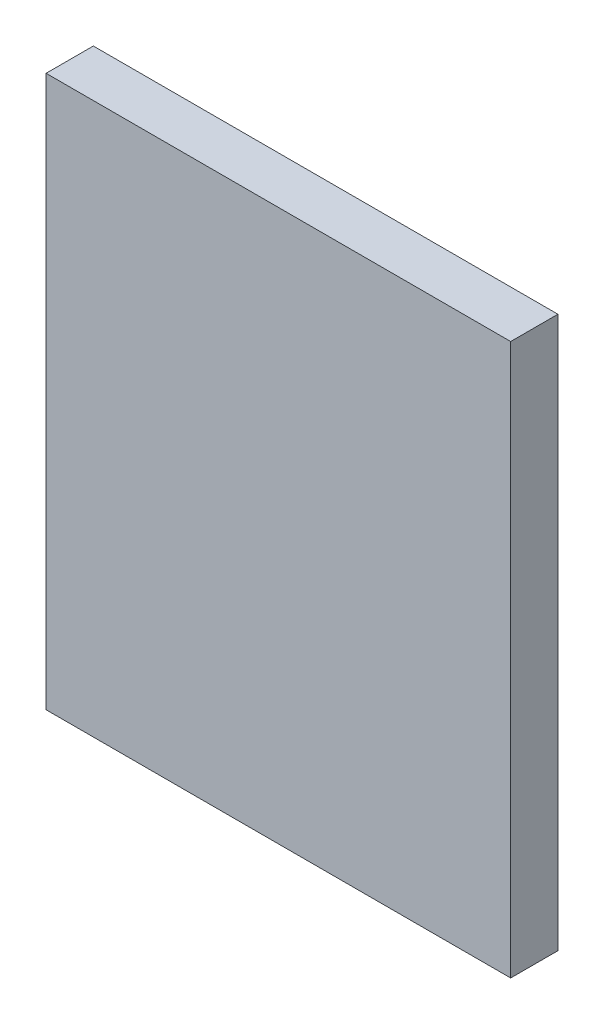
from build123d import *

# Parameters (mm, degrees)
ESQUISSE1_W        = 29.5
ESQUISSE1_H        = 35
BOSS_EXTRU_1_DEPTH = 3


with BuildPart() as part:
    # Esquisse1 → Boss.-Extru.1 (new body)
    with BuildSketch(Plane.XY):
        Rectangle(ESQUISSE1_W, ESQUISSE1_H)
    extrude(amount=BOSS_EXTRU_1_DEPTH)


solid = part.part
